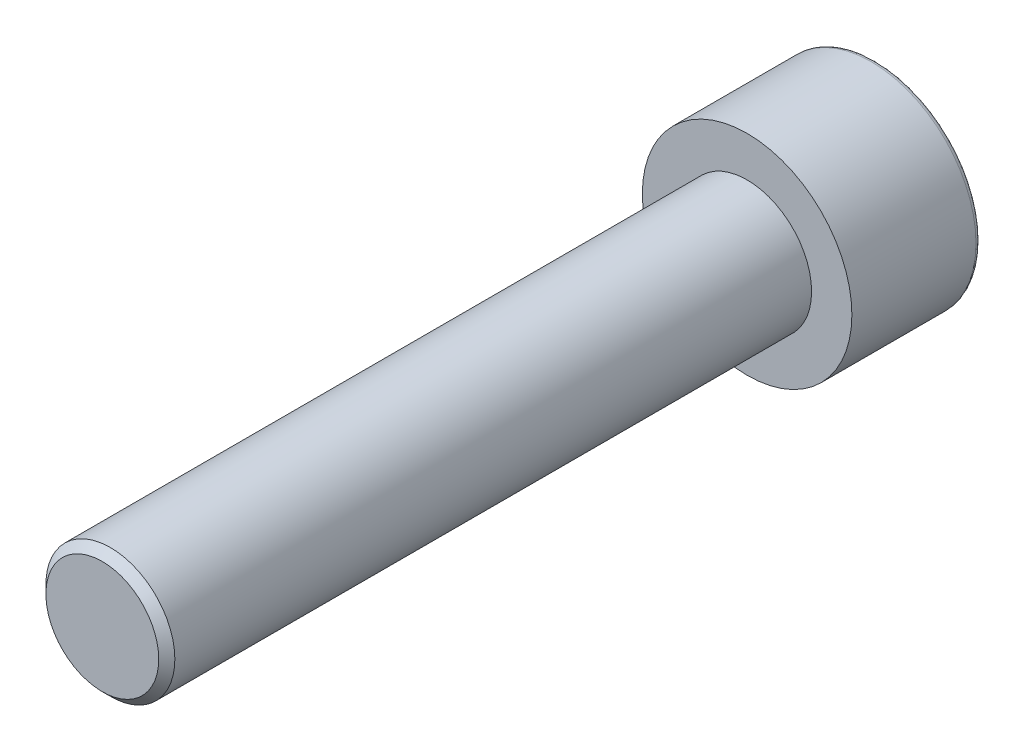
ISO-10303-21;
HEADER;
FILE_DESCRIPTION(('STEP AP214'),'2;1');
FILE_NAME('part.step','',(''),(''),'','','');
FILE_SCHEMA(('AUTOMOTIVE_DESIGN { 1 0 10303 214 1 1 1 1 }'));
ENDSEC;
DATA;
#1=APPLICATION_CONTEXT('core data for automotive mechanical design processes');
#2=APPLICATION_PROTOCOL_DEFINITION('international standard','automotive_design',2000,#1);
#3=PRODUCT_CONTEXT('',#1,'mechanical');
#4=PRODUCT('Part','Part','',(#3));
#5=PRODUCT_RELATED_PRODUCT_CATEGORY('part','',(#4));
#6=PRODUCT_DEFINITION_FORMATION('','',#4);
#7=PRODUCT_DEFINITION_CONTEXT('part definition',#1,'design');
#8=PRODUCT_DEFINITION('design','',#6,#7);
#9=PRODUCT_DEFINITION_SHAPE('','',#8);
#10=(LENGTH_UNIT() NAMED_UNIT(*) SI_UNIT(.MILLI.,.METRE.));
#11=(NAMED_UNIT(*) PLANE_ANGLE_UNIT() SI_UNIT($,.RADIAN.));
#12=(NAMED_UNIT(*) SI_UNIT($,.STERADIAN.) SOLID_ANGLE_UNIT());
#13=UNCERTAINTY_MEASURE_WITH_UNIT(LENGTH_MEASURE(1.E-05),#10,'distance_accuracy_value','');
#14=(GEOMETRIC_REPRESENTATION_CONTEXT(3) GLOBAL_UNCERTAINTY_ASSIGNED_CONTEXT((#13)) GLOBAL_UNIT_ASSIGNED_CONTEXT((#10,
#11,#12)) REPRESENTATION_CONTEXT('',''));
#15=CARTESIAN_POINT('',(0.,0.,0.));
#16=DIRECTION('',(0.,0.,1.));
#17=DIRECTION('',(1.,0.,0.));
#18=AXIS2_PLACEMENT_3D('',#15,#16,#17);
#19=CARTESIAN_POINT('',(0.,0.,8.));
#20=DIRECTION('',(0.,0.,1.));
#21=DIRECTION('',(1.,0.,0.));
#22=AXIS2_PLACEMENT_3D('',#19,#20,#21);
#23=PLANE('',#22);
#24=CARTESIAN_POINT('',(0.,0.,8.));
#25=DIRECTION('',(0.,0.,1.));
#26=DIRECTION('',(1.,0.,0.));
#27=AXIS2_PLACEMENT_3D('',#24,#25,#26);
#28=CIRCLE('',#27,6.5);
#29=CARTESIAN_POINT('',(6.5,0.,8.));
#30=VERTEX_POINT('',#29);
#31=EDGE_CURVE('E143',#30,#30,#28,.T.);
#32=ORIENTED_EDGE('',*,*,#31,.T.);
#33=EDGE_LOOP('',(#32));
#34=FACE_BOUND('',#33,.T.);
#35=CARTESIAN_POINT('',(0.,0.,8.));
#36=DIRECTION('',(0.,0.,1.));
#37=DIRECTION('',(1.,0.,0.));
#38=AXIS2_PLACEMENT_3D('',#35,#36,#37);
#39=CIRCLE('',#38,4.);
#40=CARTESIAN_POINT('',(4.,0.,8.));
#41=VERTEX_POINT('',#40);
#42=EDGE_CURVE('E134',#41,#41,#39,.T.);
#43=ORIENTED_EDGE('',*,*,#42,.F.);
#44=EDGE_LOOP('',(#43));
#45=FACE_BOUND('',#44,.T.);
#46=ADVANCED_FACE('F32',(#34,#45),#23,.T.);
#47=CARTESIAN_POINT('',(0.,0.,8.));
#48=DIRECTION('',(0.,0.,-1.));
#49=DIRECTION('',(-1.,0.,0.));
#50=AXIS2_PLACEMENT_3D('',#47,#48,#49);
#51=CYLINDRICAL_SURFACE('',#50,6.5);
#52=CARTESIAN_POINT('',(0.,0.,0.3));
#53=DIRECTION('',(0.,0.,1.));
#54=DIRECTION('',(1.,0.,0.));
#55=AXIS2_PLACEMENT_3D('',#52,#53,#54);
#56=CIRCLE('',#55,6.5);
#57=CARTESIAN_POINT('',(6.5,0.,0.3));
#58=VERTEX_POINT('',#57);
#59=EDGE_CURVE('E40',#58,#58,#56,.T.);
#60=ORIENTED_EDGE('',*,*,#59,.T.);
#61=EDGE_LOOP('',(#60));
#62=FACE_BOUND('',#61,.T.);
#63=ORIENTED_EDGE('',*,*,#31,.F.);
#64=EDGE_LOOP('',(#63));
#65=FACE_BOUND('',#64,.T.);
#66=ADVANCED_FACE('F34',(#62,#65),#51,.T.);
#67=CARTESIAN_POINT('',(0.,0.,0.));
#68=DIRECTION('',(0.,0.,1.));
#69=DIRECTION('',(1.,0.,0.));
#70=AXIS2_PLACEMENT_3D('',#67,#68,#69);
#71=PLANE('',#70);
#72=CARTESIAN_POINT('',(0.,0.,0.));
#73=DIRECTION('',(0.,0.,1.));
#74=DIRECTION('',(1.,0.,0.));
#75=AXIS2_PLACEMENT_3D('',#72,#73,#74);
#76=CIRCLE('',#75,6.2);
#77=CARTESIAN_POINT('',(6.2,0.,0.));
#78=VERTEX_POINT('',#77);
#79=EDGE_CURVE('E11',#78,#78,#76,.F.);
#80=ORIENTED_EDGE('',*,*,#79,.T.);
#81=EDGE_LOOP('',(#80));
#82=FACE_BOUND('',#81,.T.);
#83=DIRECTION('',(1.,0.,0.));
#84=VECTOR('',#83,1.);
#85=CARTESIAN_POINT('',(-1.73205080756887,-3.,0.));
#86=LINE('',#85,#84);
#87=CARTESIAN_POINT('',(-1.73205080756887,-3.,0.));
#88=VERTEX_POINT('',#87);
#89=CARTESIAN_POINT('',(1.73205080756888,-3.,0.));
#90=VERTEX_POINT('',#89);
#91=EDGE_CURVE('E102',#88,#90,#86,.T.);
#92=ORIENTED_EDGE('',*,*,#91,.T.);
#93=DIRECTION('',(-0.500000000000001,-0.866025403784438,0.));
#94=VECTOR('',#93,1.);
#95=CARTESIAN_POINT('',(3.46410161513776,0.,0.));
#96=LINE('',#95,#94);
#97=CARTESIAN_POINT('',(3.46410161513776,0.,0.));
#98=VERTEX_POINT('',#97);
#99=EDGE_CURVE('E47',#98,#90,#96,.T.);
#100=ORIENTED_EDGE('',*,*,#99,.F.);
#101=DIRECTION('',(0.500000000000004,-0.866025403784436,0.));
#102=VECTOR('',#101,1.);
#103=CARTESIAN_POINT('',(1.73205080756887,3.,0.));
#104=LINE('',#103,#102);
#105=CARTESIAN_POINT('',(1.73205080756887,3.,0.));
#106=VERTEX_POINT('',#105);
#107=EDGE_CURVE('E117',#106,#98,#104,.T.);
#108=ORIENTED_EDGE('',*,*,#107,.F.);
#109=DIRECTION('',(1.,0.,0.));
#110=VECTOR('',#109,1.);
#111=CARTESIAN_POINT('',(-1.73205080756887,3.,0.));
#112=LINE('',#111,#110);
#113=CARTESIAN_POINT('',(-1.73205080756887,3.,0.));
#114=VERTEX_POINT('',#113);
#115=EDGE_CURVE('E111',#114,#106,#112,.T.);
#116=ORIENTED_EDGE('',*,*,#115,.F.);
#117=DIRECTION('',(-0.500000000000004,-0.866025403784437,0.));
#118=VECTOR('',#117,1.);
#119=CARTESIAN_POINT('',(-1.73205080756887,3.,0.));
#120=LINE('',#119,#118);
#121=CARTESIAN_POINT('',(-3.46410161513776,0.,0.));
#122=VERTEX_POINT('',#121);
#123=EDGE_CURVE('E109',#114,#122,#120,.T.);
#124=ORIENTED_EDGE('',*,*,#123,.T.);
#125=DIRECTION('',(0.500000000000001,-0.866025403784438,0.));
#126=VECTOR('',#125,1.);
#127=CARTESIAN_POINT('',(-3.46410161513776,0.,0.));
#128=LINE('',#127,#126);
#129=EDGE_CURVE('E92',#122,#88,#128,.T.);
#130=ORIENTED_EDGE('',*,*,#129,.T.);
#131=EDGE_LOOP('',(#92,#100,#108,#116,#124,#130));
#132=FACE_BOUND('',#131,.T.);
#133=ADVANCED_FACE('F106',(#82,#132),#71,.F.);
#134=CARTESIAN_POINT('',(0.,0.,48.));
#135=DIRECTION('',(0.,0.,-1.));
#136=DIRECTION('',(-1.,0.,0.));
#137=AXIS2_PLACEMENT_3D('',#134,#135,#136);
#138=CYLINDRICAL_SURFACE('',#137,4.);
#139=CARTESIAN_POINT('',(0.,0.,47.5));
#140=DIRECTION('',(0.,0.,1.));
#141=DIRECTION('',(1.,0.,0.));
#142=AXIS2_PLACEMENT_3D('',#139,#140,#141);
#143=CIRCLE('',#142,4.);
#144=CARTESIAN_POINT('',(4.,0.,47.5));
#145=VERTEX_POINT('',#144);
#146=EDGE_CURVE('E149',#145,#145,#143,.F.);
#147=ORIENTED_EDGE('',*,*,#146,.T.);
#148=EDGE_LOOP('',(#147));
#149=FACE_BOUND('',#148,.T.);
#150=ORIENTED_EDGE('',*,*,#42,.T.);
#151=EDGE_LOOP('',(#150));
#152=FACE_BOUND('',#151,.T.);
#153=ADVANCED_FACE('F176',(#149,#152),#138,.T.);
#154=CARTESIAN_POINT('',(0.,0.,48.));
#155=DIRECTION('',(0.,0.,1.));
#156=DIRECTION('',(1.,0.,0.));
#157=AXIS2_PLACEMENT_3D('',#154,#155,#156);
#158=PLANE('',#157);
#159=CARTESIAN_POINT('',(0.,0.,48.));
#160=DIRECTION('',(0.,0.,1.));
#161=DIRECTION('',(1.,0.,0.));
#162=AXIS2_PLACEMENT_3D('',#159,#160,#161);
#163=CIRCLE('',#162,3.49999999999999);
#164=CARTESIAN_POINT('',(3.49999999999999,0.,48.));
#165=VERTEX_POINT('',#164);
#166=EDGE_CURVE('E146',#165,#165,#163,.T.);
#167=ORIENTED_EDGE('',*,*,#166,.T.);
#168=EDGE_LOOP('',(#167));
#169=FACE_BOUND('',#168,.T.);
#170=ADVANCED_FACE('F180',(#169),#158,.T.);
#171=CARTESIAN_POINT('',(0.,0.,48.));
#172=DIRECTION('',(0.,0.,-1.));
#173=DIRECTION('',(-1.,0.,0.));
#174=AXIS2_PLACEMENT_3D('',#171,#172,#173);
#175=CONICAL_SURFACE('',#174,3.49999999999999,0.785398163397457);
#176=ORIENTED_EDGE('',*,*,#146,.F.);
#177=EDGE_LOOP('',(#176));
#178=FACE_BOUND('',#177,.T.);
#179=ORIENTED_EDGE('',*,*,#166,.F.);
#180=EDGE_LOOP('',(#179));
#181=FACE_BOUND('',#180,.T.);
#182=ADVANCED_FACE('F184',(#178,#181),#175,.T.);
#183=CARTESIAN_POINT('',(3.46410161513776,0.,6.));
#184=DIRECTION('',(0.866025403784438,-0.500000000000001,0.));
#185=DIRECTION('',(0.500000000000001,0.866025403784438,0.));
#186=AXIS2_PLACEMENT_3D('',#183,#184,#185);
#187=PLANE('',#186);
#188=ORIENTED_EDGE('',*,*,#99,.T.);
#189=DIRECTION('',(0.,0.,-1.));
#190=VECTOR('',#189,1.);
#191=CARTESIAN_POINT('',(1.73205080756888,-3.,6.));
#192=LINE('',#191,#190);
#193=CARTESIAN_POINT('',(1.73205080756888,-3.,6.));
#194=VERTEX_POINT('',#193);
#195=EDGE_CURVE('E99',#194,#90,#192,.T.);
#196=ORIENTED_EDGE('',*,*,#195,.F.);
#197=DIRECTION('',(-0.500000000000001,-0.866025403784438,0.));
#198=VECTOR('',#197,1.);
#199=CARTESIAN_POINT('',(3.46410161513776,0.,6.));
#200=LINE('',#199,#198);
#201=CARTESIAN_POINT('',(3.46410161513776,0.,6.));
#202=VERTEX_POINT('',#201);
#203=EDGE_CURVE('E119',#202,#194,#200,.T.);
#204=ORIENTED_EDGE('',*,*,#203,.F.);
#205=DIRECTION('',(0.,0.,-1.));
#206=VECTOR('',#205,1.);
#207=CARTESIAN_POINT('',(3.46410161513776,0.,6.));
#208=LINE('',#207,#206);
#209=EDGE_CURVE('E54',#202,#98,#208,.T.);
#210=ORIENTED_EDGE('',*,*,#209,.T.);
#211=EDGE_LOOP('',(#188,#196,#204,#210));
#212=FACE_BOUND('',#211,.T.);
#213=ADVANCED_FACE('F188',(#212),#187,.F.);
#214=CARTESIAN_POINT('',(1.73205080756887,3.,6.));
#215=DIRECTION('',(0.866025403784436,0.500000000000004,0.));
#216=DIRECTION('',(-0.500000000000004,0.866025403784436,0.));
#217=AXIS2_PLACEMENT_3D('',#214,#215,#216);
#218=PLANE('',#217);
#219=ORIENTED_EDGE('',*,*,#107,.T.);
#220=ORIENTED_EDGE('',*,*,#209,.F.);
#221=DIRECTION('',(0.500000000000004,-0.866025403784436,0.));
#222=VECTOR('',#221,1.);
#223=CARTESIAN_POINT('',(1.73205080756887,3.,6.));
#224=LINE('',#223,#222);
#225=CARTESIAN_POINT('',(1.73205080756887,3.,6.));
#226=VERTEX_POINT('',#225);
#227=EDGE_CURVE('E130',#226,#202,#224,.T.);
#228=ORIENTED_EDGE('',*,*,#227,.F.);
#229=DIRECTION('',(0.,0.,-1.));
#230=VECTOR('',#229,1.);
#231=CARTESIAN_POINT('',(1.73205080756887,3.,6.));
#232=LINE('',#231,#230);
#233=EDGE_CURVE('E135',#226,#106,#232,.T.);
#234=ORIENTED_EDGE('',*,*,#233,.T.);
#235=EDGE_LOOP('',(#219,#220,#228,#234));
#236=FACE_BOUND('',#235,.T.);
#237=ADVANCED_FACE('F192',(#236),#218,.F.);
#238=CARTESIAN_POINT('',(-1.73205080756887,3.,6.));
#239=DIRECTION('',(0.,1.,0.));
#240=DIRECTION('',(-1.,0.,0.));
#241=AXIS2_PLACEMENT_3D('',#238,#239,#240);
#242=PLANE('',#241);
#243=ORIENTED_EDGE('',*,*,#115,.T.);
#244=ORIENTED_EDGE('',*,*,#233,.F.);
#245=DIRECTION('',(1.,0.,0.));
#246=VECTOR('',#245,1.);
#247=CARTESIAN_POINT('',(-1.73205080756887,3.,6.));
#248=LINE('',#247,#246);
#249=CARTESIAN_POINT('',(-1.73205080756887,3.,6.));
#250=VERTEX_POINT('',#249);
#251=EDGE_CURVE('E127',#250,#226,#248,.T.);
#252=ORIENTED_EDGE('',*,*,#251,.F.);
#253=DIRECTION('',(0.,0.,-1.));
#254=VECTOR('',#253,1.);
#255=CARTESIAN_POINT('',(-1.73205080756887,3.,6.));
#256=LINE('',#255,#254);
#257=EDGE_CURVE('E137',#250,#114,#256,.T.);
#258=ORIENTED_EDGE('',*,*,#257,.T.);
#259=EDGE_LOOP('',(#243,#244,#252,#258));
#260=FACE_BOUND('',#259,.T.);
#261=ADVANCED_FACE('F200',(#260),#242,.F.);
#262=CARTESIAN_POINT('',(-1.73205080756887,3.,6.));
#263=DIRECTION('',(0.866025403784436,-0.500000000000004,0.));
#264=DIRECTION('',(0.500000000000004,0.866025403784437,0.));
#265=AXIS2_PLACEMENT_3D('',#262,#263,#264);
#266=PLANE('',#265);
#267=ORIENTED_EDGE('',*,*,#123,.F.);
#268=ORIENTED_EDGE('',*,*,#257,.F.);
#269=DIRECTION('',(-0.500000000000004,-0.866025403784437,0.));
#270=VECTOR('',#269,1.);
#271=CARTESIAN_POINT('',(-1.73205080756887,3.,6.));
#272=LINE('',#271,#270);
#273=CARTESIAN_POINT('',(-3.46410161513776,0.,6.));
#274=VERTEX_POINT('',#273);
#275=EDGE_CURVE('E125',#250,#274,#272,.T.);
#276=ORIENTED_EDGE('',*,*,#275,.T.);
#277=DIRECTION('',(0.,0.,-1.));
#278=VECTOR('',#277,1.);
#279=CARTESIAN_POINT('',(-3.46410161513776,0.,6.));
#280=LINE('',#279,#278);
#281=EDGE_CURVE('E98',#274,#122,#280,.T.);
#282=ORIENTED_EDGE('',*,*,#281,.T.);
#283=EDGE_LOOP('',(#267,#268,#276,#282));
#284=FACE_BOUND('',#283,.T.);
#285=ADVANCED_FACE('F197',(#284),#266,.T.);
#286=CARTESIAN_POINT('',(-3.46410161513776,0.,6.));
#287=DIRECTION('',(0.866025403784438,0.500000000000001,0.));
#288=DIRECTION('',(-0.500000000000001,0.866025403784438,0.));
#289=AXIS2_PLACEMENT_3D('',#286,#287,#288);
#290=PLANE('',#289);
#291=ORIENTED_EDGE('',*,*,#129,.F.);
#292=ORIENTED_EDGE('',*,*,#281,.F.);
#293=DIRECTION('',(0.500000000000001,-0.866025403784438,0.));
#294=VECTOR('',#293,1.);
#295=CARTESIAN_POINT('',(-3.46410161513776,0.,6.));
#296=LINE('',#295,#294);
#297=CARTESIAN_POINT('',(-1.73205080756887,-3.,6.));
#298=VERTEX_POINT('',#297);
#299=EDGE_CURVE('E95',#274,#298,#296,.T.);
#300=ORIENTED_EDGE('',*,*,#299,.T.);
#301=DIRECTION('',(0.,0.,-1.));
#302=VECTOR('',#301,1.);
#303=CARTESIAN_POINT('',(-1.73205080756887,-3.,6.));
#304=LINE('',#303,#302);
#305=EDGE_CURVE('E87',#298,#88,#304,.T.);
#306=ORIENTED_EDGE('',*,*,#305,.T.);
#307=EDGE_LOOP('',(#291,#292,#300,#306));
#308=FACE_BOUND('',#307,.T.);
#309=ADVANCED_FACE('F89',(#308),#290,.T.);
#310=CARTESIAN_POINT('',(-1.73205080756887,-3.,6.));
#311=DIRECTION('',(0.,1.,0.));
#312=DIRECTION('',(0.,0.,1.));
#313=AXIS2_PLACEMENT_3D('',#310,#311,#312);
#314=PLANE('',#313);
#315=ORIENTED_EDGE('',*,*,#91,.F.);
#316=ORIENTED_EDGE('',*,*,#305,.F.);
#317=DIRECTION('',(1.,0.,0.));
#318=VECTOR('',#317,1.);
#319=CARTESIAN_POINT('',(-1.73205080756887,-3.,6.));
#320=LINE('',#319,#318);
#321=EDGE_CURVE('E122',#298,#194,#320,.T.);
#322=ORIENTED_EDGE('',*,*,#321,.T.);
#323=ORIENTED_EDGE('',*,*,#195,.T.);
#324=EDGE_LOOP('',(#315,#316,#322,#323));
#325=FACE_BOUND('',#324,.T.);
#326=ADVANCED_FACE('F103',(#325),#314,.T.);
#327=CARTESIAN_POINT('',(3.46410161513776,0.,6.));
#328=DIRECTION('',(0.,0.,1.));
#329=DIRECTION('',(1.,0.,0.));
#330=AXIS2_PLACEMENT_3D('',#327,#328,#329);
#331=PLANE('',#330);
#332=ORIENTED_EDGE('',*,*,#203,.T.);
#333=ORIENTED_EDGE('',*,*,#321,.F.);
#334=ORIENTED_EDGE('',*,*,#299,.F.);
#335=ORIENTED_EDGE('',*,*,#275,.F.);
#336=ORIENTED_EDGE('',*,*,#251,.T.);
#337=ORIENTED_EDGE('',*,*,#227,.T.);
#338=EDGE_LOOP('',(#332,#333,#334,#335,#336,#337));
#339=FACE_BOUND('',#338,.T.);
#340=ADVANCED_FACE('F158',(#339),#331,.F.);
#341=CARTESIAN_POINT('',(0.,0.,0.3));
#342=DIRECTION('',(0.,0.,1.));
#343=DIRECTION('',(1.,0.,0.));
#344=AXIS2_PLACEMENT_3D('',#341,#342,#343);
#345=TOROIDAL_SURFACE('',#344,6.2,0.3);
#346=ORIENTED_EDGE('',*,*,#79,.F.);
#347=EDGE_LOOP('',(#346));
#348=FACE_BOUND('',#347,.T.);
#349=ORIENTED_EDGE('',*,*,#59,.F.);
#350=EDGE_LOOP('',(#349));
#351=FACE_BOUND('',#350,.T.);
#352=ADVANCED_FACE('F156',(#348,#351),#345,.T.);
#353=CLOSED_SHELL('',(#46,#66,#133,#153,#170,#182,#213,#237,#261,#285,#309,#326,#340,#352));
#354=MANIFOLD_SOLID_BREP('B2',#353);
#355=ADVANCED_BREP_SHAPE_REPRESENTATION('',(#18,#354),#14);
#356=SHAPE_DEFINITION_REPRESENTATION(#9,#355);
ENDSEC;
END-ISO-10303-21;
